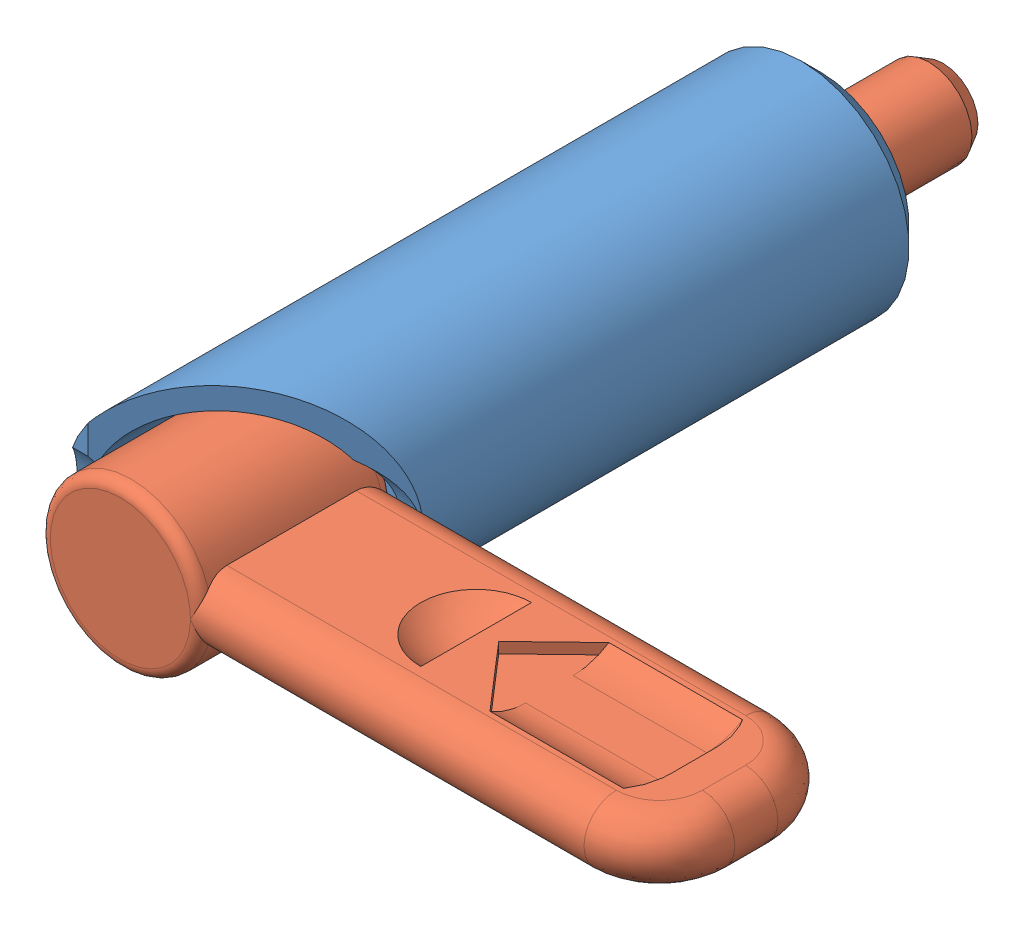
SolidWorks assembly GDX10L-4N-SUS.sldasm, configuration Default (file format 15000). Lengths in mm.
Overall size (30 10.01 38.5).
2 component instances, 2 part files, 0 mates.
Components (placement in the parent):
- GDX10L-4N-SUS_01-1: GDX10L-4N-SUS_01.SLDPRT [ﾃﾞﾌｫﾙﾄ] x (1 0 0) z (0 -1 0) size (10.01 31.09 10.01)
- GDX10L-4N-SUS_02-1: GDX10L-4N-SUS_02.SLDPRT [ﾃﾞﾌｫﾙﾄ] x (1 0 0) z (0 -1 0) size (28.75 38.5 7.5)
